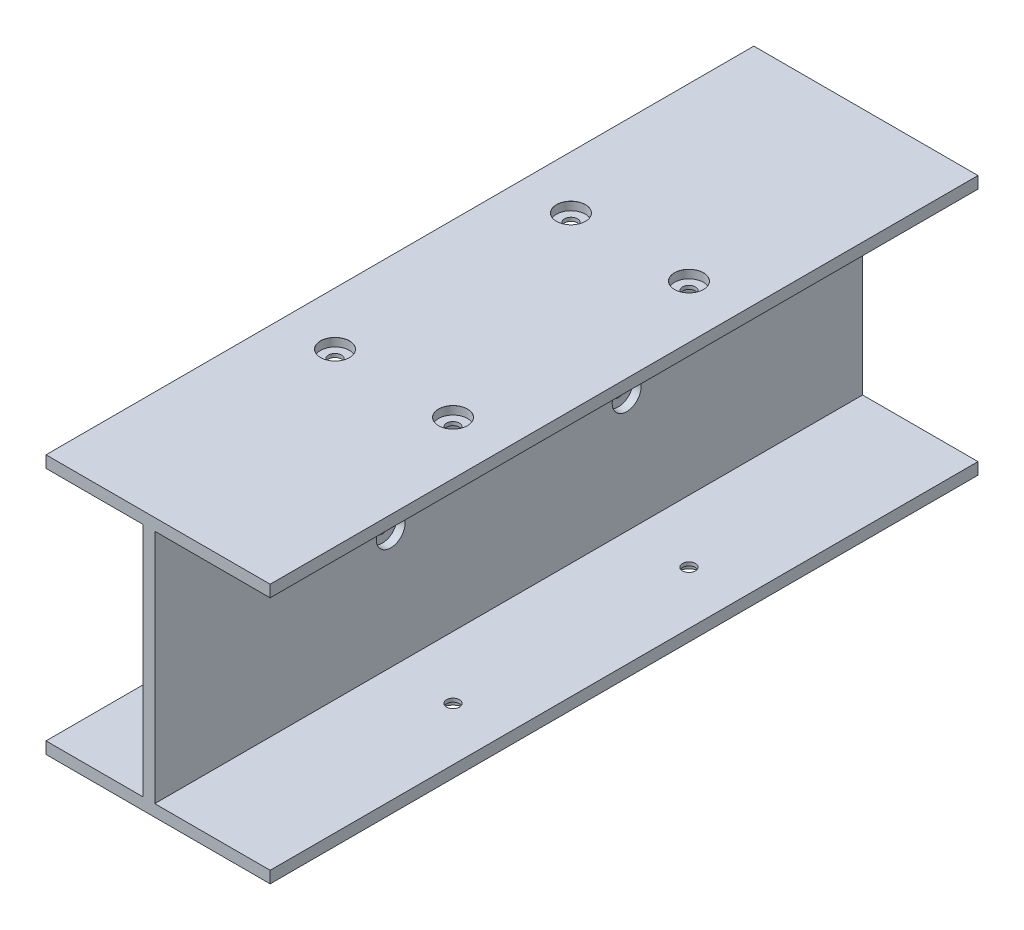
from build123d import *

# Parameters (mm, degrees)
BOSS_EXTRUDE1_DEPTH = 300
LPATTERN1_COUNT     = 2
LPATTERN1_PITCH     = 100
LPATTERN2_COUNT     = 2
LPATTERN2_PITCH     = 100
LPATTERN3_COUNT     = 2
LPATTERN3_PITCH     = 100
LPATTERN4_COUNT     = 2
LPATTERN4_PITCH     = 100
LPATTERN5_COUNT     = 2
LPATTERN5_PITCH     = 100


with BuildPart() as part:
    # Sketch1 → Boss-Extrude1 (new body)
    with BuildSketch(Plane.XY):
        Polygon((-47.5, -55), (47.5, -55), (47.5, -50), (-1.407425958, -50), (-1.407425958, 1.629651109), (-1.407425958, 50), (47.5, 50), (47.5, 55), (-47.5, 55), (-47.5, 50), (-6.407425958, 50), (-6.407425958, -50), (-47.5, -50), align=None)
    extrude(amount=BOSS_EXTRUDE1_DEPTH)

    # Sketch4 → CBORE for M5 Hex Head Bolt1 (revolve, cut)
    with BuildSketch(Plane(origin=(25, 55, 200), x_dir=(0, 0, 1), z_dir=(1, 0, 0))):
        Polygon((0, 0), (0, 11.702366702), (2.75, 10.05), (2.75, 3.5), (6.119, 3.5), (6.119, 0.025), (6.144, 0), align=None)
    cbore_for_m5_hex_head_bolt1 = revolve(axis=Axis((25, 61.35, 200), (0, -1, 0)), mode=Mode.SUBTRACT)

    # LPattern1: CBORE for M5 Hex Head Bolt1 ×2
    with Locations(*[(0, 0, -i * LPATTERN1_PITCH) for i in range(1, LPATTERN1_COUNT)]):
        add(cbore_for_m5_hex_head_bolt1, mode=Mode.SUBTRACT)

    # Sketch6 → CBORE for M5 Hex Head Bolt2 (revolve, cut)
    with BuildSketch(Plane(origin=(25, -55, 200), x_dir=(0, 0, -1), z_dir=(1, 0, 0))):
        Polygon((0, 0), (0, 11.702366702), (2.75, 10.05), (2.75, 3.5), (6.119, 3.5), (6.119, 0.025), (6.144, 0), align=None)
    cbore_for_m5_hex_head_bolt2 = revolve(axis=Axis((25, -61.35, 200), (0, 1, 0)), mode=Mode.SUBTRACT)

    # LPattern2: CBORE for M5 Hex Head Bolt2 ×2
    with Locations(*[(0, 0, -i * LPATTERN2_PITCH) for i in range(1, LPATTERN2_COUNT)]):
        add(cbore_for_m5_hex_head_bolt2, mode=Mode.SUBTRACT)

    # Sketch10 → CBORE for M5 Hex Head Bolt3 (revolve, cut)
    with BuildSketch(Plane(origin=(-25, 55, 200), x_dir=(0, 0, 1), z_dir=(1, 0, 0))):
        Polygon((0, 0), (0, 11.702366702), (2.75, 10.05), (2.75, 3.5), (6.119, 3.5), (6.119, 0.025), (6.144, 0), align=None)
    cbore_for_m5_hex_head_bolt3 = revolve(axis=Axis((-25, 61.35, 200), (0, -1, 0)), mode=Mode.SUBTRACT)

    # LPattern3: CBORE for M5 Hex Head Bolt3 ×2
    with Locations(*[(0, 0, -i * LPATTERN3_PITCH) for i in range(1, LPATTERN3_COUNT)]):
        add(cbore_for_m5_hex_head_bolt3, mode=Mode.SUBTRACT)

    # Sketch13 → CBORE for M5 Hex Head Bolt4 (revolve, cut)
    with BuildSketch(Plane(origin=(-25, -55, 200), x_dir=(0, 0, -1), z_dir=(1, 0, 0))):
        Polygon((0, 0), (0, 11.702366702), (2.75, 10.05), (2.75, 3.5), (6.119, 3.5), (6.119, 0.025), (6.144, 0), align=None)
    cbore_for_m5_hex_head_bolt4 = revolve(axis=Axis((-25, -61.35, 200), (0, 1, 0)), mode=Mode.SUBTRACT)

    # LPattern4: CBORE for M5 Hex Head Bolt4 ×2
    with Locations(*[(0, 0, -i * LPATTERN4_PITCH) for i in range(1, LPATTERN4_COUNT)]):
        add(cbore_for_m5_hex_head_bolt4, mode=Mode.SUBTRACT)

    # Sketch20 → CBORE for M5 Hex Head Bolt5 (revolve, cut)
    with BuildSketch(Plane(origin=(-1.407425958, 0, 200), x_dir=(0, 0, -1), z_dir=(0, 1, 0))):
        Polygon((0, 0), (0, 11.702366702), (2.75, 10.05), (2.75, 3.5), (6.119, 3.5), (6.119, 0), align=None)
    cbore_for_m5_hex_head_bolt5 = revolve(axis=Axis((4.942574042, 0, 200), (-1, 0, 0)), mode=Mode.SUBTRACT)

    # LPattern5: CBORE for M5 Hex Head Bolt5 ×2
    with Locations(*[(0, 0, -i * LPATTERN5_PITCH) for i in range(1, LPATTERN5_COUNT)]):
        add(cbore_for_m5_hex_head_bolt5, mode=Mode.SUBTRACT)


solid = part.part
